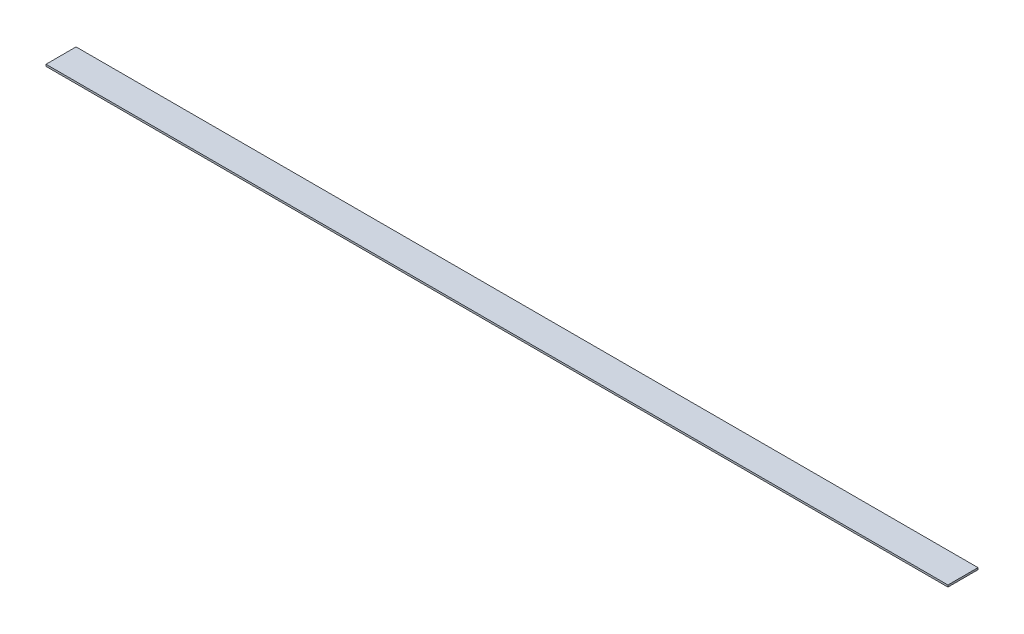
ISO-10303-21;
HEADER;
FILE_DESCRIPTION(('STEP AP214'),'2;1');
FILE_NAME('part.step','',(''),(''),'','','');
FILE_SCHEMA(('AUTOMOTIVE_DESIGN { 1 0 10303 214 1 1 1 1 }'));
ENDSEC;
DATA;
#1=APPLICATION_CONTEXT('core data for automotive mechanical design processes');
#2=APPLICATION_PROTOCOL_DEFINITION('international standard','automotive_design',2000,#1);
#3=PRODUCT_CONTEXT('',#1,'mechanical');
#4=PRODUCT('Part','Part','',(#3));
#5=PRODUCT_RELATED_PRODUCT_CATEGORY('part','',(#4));
#6=PRODUCT_DEFINITION_FORMATION('','',#4);
#7=PRODUCT_DEFINITION_CONTEXT('part definition',#1,'design');
#8=PRODUCT_DEFINITION('design','',#6,#7);
#9=PRODUCT_DEFINITION_SHAPE('','',#8);
#10=(LENGTH_UNIT() NAMED_UNIT(*) SI_UNIT(.MILLI.,.METRE.));
#11=(NAMED_UNIT(*) PLANE_ANGLE_UNIT() SI_UNIT($,.RADIAN.));
#12=(NAMED_UNIT(*) SI_UNIT($,.STERADIAN.) SOLID_ANGLE_UNIT());
#13=UNCERTAINTY_MEASURE_WITH_UNIT(LENGTH_MEASURE(1.E-05),#10,'distance_accuracy_value','');
#14=(GEOMETRIC_REPRESENTATION_CONTEXT(3) GLOBAL_UNCERTAINTY_ASSIGNED_CONTEXT((#13)) GLOBAL_UNIT_ASSIGNED_CONTEXT((#10,
#11,#12)) REPRESENTATION_CONTEXT('',''));
#15=CARTESIAN_POINT('',(0.,0.,0.));
#16=DIRECTION('',(0.,0.,1.));
#17=DIRECTION('',(1.,0.,0.));
#18=AXIS2_PLACEMENT_3D('',#15,#16,#17);
#19=CARTESIAN_POINT('',(1524.,6.35,-50.8));
#20=DIRECTION('',(-1.,0.,0.));
#21=DIRECTION('',(0.,0.,1.));
#22=AXIS2_PLACEMENT_3D('',#19,#20,#21);
#23=PLANE('',#22);
#24=DIRECTION('',(0.,0.,-1.));
#25=VECTOR('',#24,1.);
#26=CARTESIAN_POINT('',(1524.,0.,-50.8));
#27=LINE('',#26,#25);
#28=CARTESIAN_POINT('',(1524.,0.,50.8));
#29=VERTEX_POINT('',#28);
#30=CARTESIAN_POINT('',(1524.,0.,-50.8));
#31=VERTEX_POINT('',#30);
#32=EDGE_CURVE('E97',#29,#31,#27,.T.);
#33=ORIENTED_EDGE('',*,*,#32,.T.);
#34=DIRECTION('',(0.,-1.,0.));
#35=VECTOR('',#34,1.);
#36=CARTESIAN_POINT('',(1524.,6.35,-50.8));
#37=LINE('',#36,#35);
#38=CARTESIAN_POINT('',(1524.,6.35,-50.8));
#39=VERTEX_POINT('',#38);
#40=EDGE_CURVE('E11',#39,#31,#37,.T.);
#41=ORIENTED_EDGE('',*,*,#40,.F.);
#42=DIRECTION('',(0.,0.,-1.));
#43=VECTOR('',#42,1.);
#44=CARTESIAN_POINT('',(1524.,6.35,-50.8));
#45=LINE('',#44,#43);
#46=CARTESIAN_POINT('',(1524.,6.35,50.8));
#47=VERTEX_POINT('',#46);
#48=EDGE_CURVE('E85',#47,#39,#45,.T.);
#49=ORIENTED_EDGE('',*,*,#48,.F.);
#50=DIRECTION('',(0.,-1.,0.));
#51=VECTOR('',#50,1.);
#52=CARTESIAN_POINT('',(1524.,6.35,50.8));
#53=LINE('',#52,#51);
#54=EDGE_CURVE('E93',#47,#29,#53,.T.);
#55=ORIENTED_EDGE('',*,*,#54,.T.);
#56=EDGE_LOOP('',(#33,#41,#49,#55));
#57=FACE_BOUND('',#56,.T.);
#58=ADVANCED_FACE('F34',(#57),#23,.F.);
#59=CARTESIAN_POINT('',(-1524.,6.35,-50.8));
#60=DIRECTION('',(0.,0.,1.));
#61=DIRECTION('',(1.,0.,0.));
#62=AXIS2_PLACEMENT_3D('',#59,#60,#61);
#63=PLANE('',#62);
#64=DIRECTION('',(-1.,0.,0.));
#65=VECTOR('',#64,1.);
#66=CARTESIAN_POINT('',(-1524.,0.,-50.8));
#67=LINE('',#66,#65);
#68=CARTESIAN_POINT('',(-1524.,0.,-50.8));
#69=VERTEX_POINT('',#68);
#70=EDGE_CURVE('E89',#31,#69,#67,.T.);
#71=ORIENTED_EDGE('',*,*,#70,.T.);
#72=DIRECTION('',(0.,-1.,0.));
#73=VECTOR('',#72,1.);
#74=CARTESIAN_POINT('',(-1524.,6.35,-50.8));
#75=LINE('',#74,#73);
#76=CARTESIAN_POINT('',(-1524.,6.35,-50.8));
#77=VERTEX_POINT('',#76);
#78=EDGE_CURVE('E42',#77,#69,#75,.T.);
#79=ORIENTED_EDGE('',*,*,#78,.F.);
#80=DIRECTION('',(-1.,0.,0.));
#81=VECTOR('',#80,1.);
#82=CARTESIAN_POINT('',(-1524.,6.35,-50.8));
#83=LINE('',#82,#81);
#84=EDGE_CURVE('E80',#39,#77,#83,.T.);
#85=ORIENTED_EDGE('',*,*,#84,.F.);
#86=ORIENTED_EDGE('',*,*,#40,.T.);
#87=EDGE_LOOP('',(#71,#79,#85,#86));
#88=FACE_BOUND('',#87,.T.);
#89=ADVANCED_FACE('F88',(#88),#63,.F.);
#90=CARTESIAN_POINT('',(-1524.,6.35,-50.8));
#91=DIRECTION('',(1.,0.,0.));
#92=DIRECTION('',(0.,0.,-1.));
#93=AXIS2_PLACEMENT_3D('',#90,#91,#92);
#94=PLANE('',#93);
#95=DIRECTION('',(0.,0.,1.));
#96=VECTOR('',#95,1.);
#97=CARTESIAN_POINT('',(-1524.,0.,-50.8));
#98=LINE('',#97,#96);
#99=CARTESIAN_POINT('',(-1524.,0.,50.8));
#100=VERTEX_POINT('',#99);
#101=EDGE_CURVE('E67',#69,#100,#98,.T.);
#102=ORIENTED_EDGE('',*,*,#101,.T.);
#103=DIRECTION('',(0.,-1.,0.));
#104=VECTOR('',#103,1.);
#105=CARTESIAN_POINT('',(-1524.,6.35,50.8));
#106=LINE('',#105,#104);
#107=CARTESIAN_POINT('',(-1524.,6.35,50.8));
#108=VERTEX_POINT('',#107);
#109=EDGE_CURVE('E90',#108,#100,#106,.T.);
#110=ORIENTED_EDGE('',*,*,#109,.F.);
#111=DIRECTION('',(0.,0.,1.));
#112=VECTOR('',#111,1.);
#113=CARTESIAN_POINT('',(-1524.,6.35,-50.8));
#114=LINE('',#113,#112);
#115=EDGE_CURVE('E83',#77,#108,#114,.T.);
#116=ORIENTED_EDGE('',*,*,#115,.F.);
#117=ORIENTED_EDGE('',*,*,#78,.T.);
#118=EDGE_LOOP('',(#102,#110,#116,#117));
#119=FACE_BOUND('',#118,.T.);
#120=ADVANCED_FACE('F91',(#119),#94,.F.);
#121=CARTESIAN_POINT('',(-1524.,6.35,50.8));
#122=DIRECTION('',(0.,0.,-1.));
#123=DIRECTION('',(-1.,0.,0.));
#124=AXIS2_PLACEMENT_3D('',#121,#122,#123);
#125=PLANE('',#124);
#126=DIRECTION('',(1.,0.,0.));
#127=VECTOR('',#126,1.);
#128=CARTESIAN_POINT('',(-1524.,0.,50.8));
#129=LINE('',#128,#127);
#130=EDGE_CURVE('E73',#100,#29,#129,.T.);
#131=ORIENTED_EDGE('',*,*,#130,.T.);
#132=ORIENTED_EDGE('',*,*,#54,.F.);
#133=DIRECTION('',(1.,0.,0.));
#134=VECTOR('',#133,1.);
#135=CARTESIAN_POINT('',(-1524.,6.35,50.8));
#136=LINE('',#135,#134);
#137=EDGE_CURVE('E50',#108,#47,#136,.T.);
#138=ORIENTED_EDGE('',*,*,#137,.F.);
#139=ORIENTED_EDGE('',*,*,#109,.T.);
#140=EDGE_LOOP('',(#131,#132,#138,#139));
#141=FACE_BOUND('',#140,.T.);
#142=ADVANCED_FACE('F104',(#141),#125,.F.);
#143=CARTESIAN_POINT('',(1524.,6.35,50.8));
#144=DIRECTION('',(0.,1.,0.));
#145=DIRECTION('',(0.,0.,1.));
#146=AXIS2_PLACEMENT_3D('',#143,#144,#145);
#147=PLANE('',#146);
#148=ORIENTED_EDGE('',*,*,#48,.T.);
#149=ORIENTED_EDGE('',*,*,#84,.T.);
#150=ORIENTED_EDGE('',*,*,#115,.T.);
#151=ORIENTED_EDGE('',*,*,#137,.T.);
#152=EDGE_LOOP('',(#148,#149,#150,#151));
#153=FACE_BOUND('',#152,.T.);
#154=ADVANCED_FACE('F81',(#153),#147,.T.);
#155=CARTESIAN_POINT('',(1524.,0.,50.8));
#156=DIRECTION('',(0.,1.,0.));
#157=DIRECTION('',(0.,0.,1.));
#158=AXIS2_PLACEMENT_3D('',#155,#156,#157);
#159=PLANE('',#158);
#160=ORIENTED_EDGE('',*,*,#32,.F.);
#161=ORIENTED_EDGE('',*,*,#130,.F.);
#162=ORIENTED_EDGE('',*,*,#101,.F.);
#163=ORIENTED_EDGE('',*,*,#70,.F.);
#164=EDGE_LOOP('',(#160,#161,#162,#163));
#165=FACE_BOUND('',#164,.T.);
#166=ADVANCED_FACE('F107',(#165),#159,.F.);
#167=CLOSED_SHELL('',(#58,#89,#120,#142,#154,#166));
#168=MANIFOLD_SOLID_BREP('B2',#167);
#169=ADVANCED_BREP_SHAPE_REPRESENTATION('',(#18,#168),#14);
#170=SHAPE_DEFINITION_REPRESENTATION(#9,#169);
ENDSEC;
END-ISO-10303-21;
